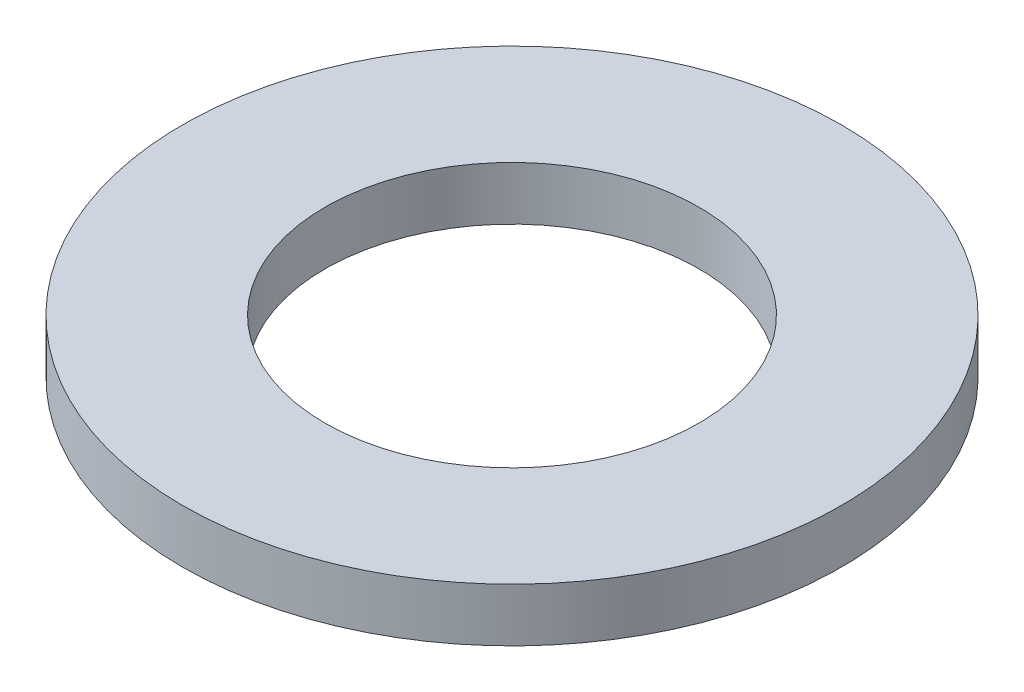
from build123d import *

# Parameters (mm, degrees)
SKETCH1_R      = 18.5
SKETCH1_R_2    = 10.5
EXTRUDE1_DEPTH = 3


with BuildPart() as part:
    # Sketch1 → Extrude1 (new body)
    with BuildSketch(Plane(origin=(0, 0, 0), x_dir=(1, 0, 0), z_dir=(0, 1, 0))):
        with Locations(Location((0, 0, 0), (0, 0, 270))):
            Circle(SKETCH1_R)
        with Locations(Location((0, 0, 0), (0, 0, 270))):
            Circle(SKETCH1_R_2, mode=Mode.SUBTRACT)
    extrude(amount=EXTRUDE1_DEPTH)


solid = part.part
